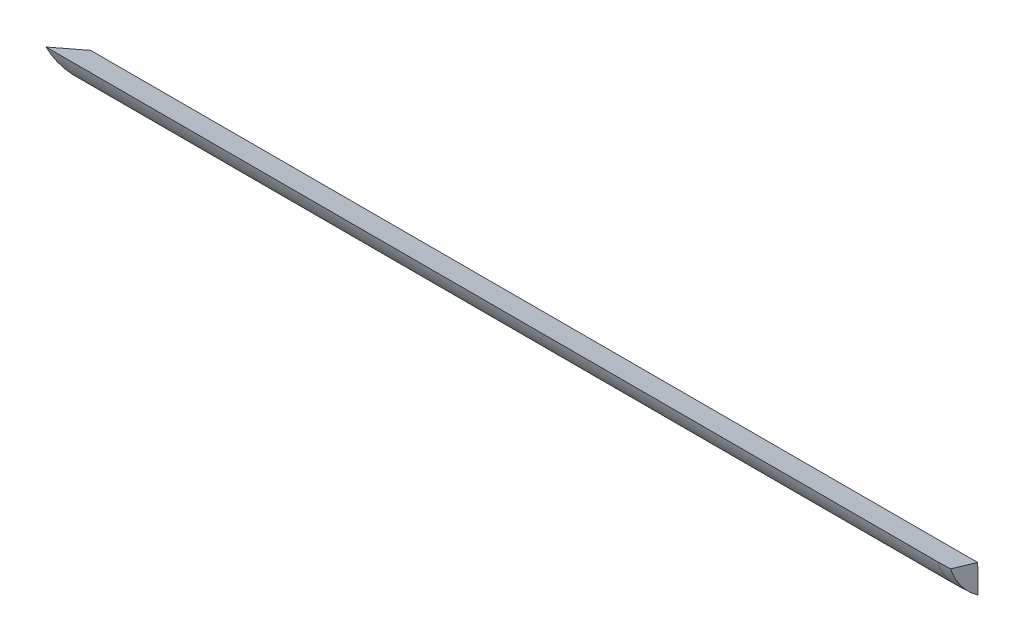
ISO-10303-21;
HEADER;
FILE_DESCRIPTION(('STEP AP214'),'2;1');
FILE_NAME('part.step','',(''),(''),'','','');
FILE_SCHEMA(('AUTOMOTIVE_DESIGN { 1 0 10303 214 1 1 1 1 }'));
ENDSEC;
DATA;
#1=APPLICATION_CONTEXT('core data for automotive mechanical design processes');
#2=APPLICATION_PROTOCOL_DEFINITION('international standard','automotive_design',2000,#1);
#3=PRODUCT_CONTEXT('',#1,'mechanical');
#4=PRODUCT('Part','Part','',(#3));
#5=PRODUCT_RELATED_PRODUCT_CATEGORY('part','',(#4));
#6=PRODUCT_DEFINITION_FORMATION('','',#4);
#7=PRODUCT_DEFINITION_CONTEXT('part definition',#1,'design');
#8=PRODUCT_DEFINITION('design','',#6,#7);
#9=PRODUCT_DEFINITION_SHAPE('','',#8);
#10=(LENGTH_UNIT() NAMED_UNIT(*) SI_UNIT(.MILLI.,.METRE.));
#11=(NAMED_UNIT(*) PLANE_ANGLE_UNIT() SI_UNIT($,.RADIAN.));
#12=(NAMED_UNIT(*) SI_UNIT($,.STERADIAN.) SOLID_ANGLE_UNIT());
#13=UNCERTAINTY_MEASURE_WITH_UNIT(LENGTH_MEASURE(1.E-05),#10,'distance_accuracy_value','');
#14=(GEOMETRIC_REPRESENTATION_CONTEXT(3) GLOBAL_UNCERTAINTY_ASSIGNED_CONTEXT((#13)) GLOBAL_UNIT_ASSIGNED_CONTEXT((#10,
#11,#12)) REPRESENTATION_CONTEXT('',''));
#15=CARTESIAN_POINT('',(0.,0.,0.));
#16=DIRECTION('',(0.,0.,1.));
#17=DIRECTION('',(1.,0.,0.));
#18=AXIS2_PLACEMENT_3D('',#15,#16,#17);
#19=CARTESIAN_POINT('',(38.0952752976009,-83.4050358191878,23.));
#20=CARTESIAN_POINT('',(38.0952752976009,-83.3393714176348,23.));
#21=CARTESIAN_POINT('',(38.0952752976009,-83.2080426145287,23.));
#22=CARTESIAN_POINT('',(38.0952752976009,-83.0329375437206,23.));
#23=CARTESIAN_POINT('',(38.0952752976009,-82.9016087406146,23.));
#24=CARTESIAN_POINT('',(38.0952752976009,-82.7702799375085,23.));
#25=CARTESIAN_POINT('',(38.0952752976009,-82.6170630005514,23.));
#26=CARTESIAN_POINT('',(38.0952752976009,-82.4638460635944,23.));
#27=CARTESIAN_POINT('',(38.0952752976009,-82.3325172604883,23.));
#28=CARTESIAN_POINT('',(38.0952752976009,-82.2011884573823,23.));
#29=CARTESIAN_POINT('',(38.0952752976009,-82.0260833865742,23.));
#30=CARTESIAN_POINT('',(38.0952752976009,-81.8947545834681,23.));
#31=CARTESIAN_POINT('',(38.0952752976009,-81.8290901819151,23.));
#32=CARTESIAN_POINT('',(37.8896109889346,-83.1671640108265,23.3258381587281));
#33=CARTESIAN_POINT('',(37.896231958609,-83.1153063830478,23.3157647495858));
#34=CARTESIAN_POINT('',(37.9094738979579,-83.0115911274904,23.2956179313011));
#35=CARTESIAN_POINT('',(37.9269828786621,-82.8732630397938,23.2686112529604));
#36=CARTESIAN_POINT('',(37.9400473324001,-82.7694977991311,23.2482896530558));
#37=CARTESIAN_POINT('',(37.9530684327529,-82.6657200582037,23.227925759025));
#38=CARTESIAN_POINT('',(37.9681899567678,-82.5446258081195,23.2041002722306));
#39=CARTESIAN_POINT('',(37.9832127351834,-82.4235030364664,23.1801706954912));
#40=CARTESIAN_POINT('',(37.9960267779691,-82.3196644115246,23.1596051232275));
#41=CARTESIAN_POINT('',(38.0087941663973,-82.2158113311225,23.1390017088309));
#42=CARTESIAN_POINT('',(38.0257150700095,-82.0773078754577,23.1114598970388));
#43=CARTESIAN_POINT('',(38.0382658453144,-81.9733829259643,23.090739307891));
#44=CARTESIAN_POINT('',(38.0445412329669,-81.9214204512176,23.0803790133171));
#45=CARTESIAN_POINT('',(37.7041022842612,-82.8742570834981,23.6197433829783));
#46=CARTESIAN_POINT('',(37.717442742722,-82.8364116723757,23.5994466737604));
#47=CARTESIAN_POINT('',(37.7441236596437,-82.760720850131,23.5588532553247));
#48=CARTESIAN_POINT('',(37.7794021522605,-82.659716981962,23.5044380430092));
#49=CARTESIAN_POINT('',(37.8057254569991,-82.5839254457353,23.4634924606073));
#50=CARTESIAN_POINT('',(37.8319614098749,-82.5081087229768,23.4224616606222));
#51=CARTESIAN_POINT('',(37.8624294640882,-82.4196151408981,23.374456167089));
#52=CARTESIAN_POINT('',(37.8926985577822,-82.3310640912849,23.3262409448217));
#53=CARTESIAN_POINT('',(37.918517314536,-82.2551246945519,23.2848037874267));
#54=CARTESIAN_POINT('',(37.9442420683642,-82.1791561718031,23.2432903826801));
#55=CARTESIAN_POINT('',(37.9783356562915,-82.0777989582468,23.1877969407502));
#56=CARTESIAN_POINT('',(38.0036239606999,-82.0016856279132,23.1460474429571));
#57=CARTESIAN_POINT('',(38.0162681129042,-81.9636289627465,23.1251726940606));
#58=CARTESIAN_POINT('',(37.5433395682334,-82.5316242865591,23.8744430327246));
#59=CARTESIAN_POINT('',(37.5635002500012,-82.5080011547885,23.8437697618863));
#60=CARTESIAN_POINT('',(37.6038216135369,-82.4607548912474,23.7824232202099));
#61=CARTESIAN_POINT('',(37.6571360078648,-82.3976347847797,23.7001885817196));
#62=CARTESIAN_POINT('',(37.6969169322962,-82.3502363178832,23.6383098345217));
#63=CARTESIAN_POINT('',(37.7365658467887,-82.3027997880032,23.5763023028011));
#64=CARTESIAN_POINT('',(37.7826104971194,-82.2473956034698,23.503754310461));
#65=CARTESIAN_POINT('',(37.8283544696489,-82.1919045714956,23.4308893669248));
#66=CARTESIAN_POINT('',(37.8673728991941,-82.1442826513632,23.3682677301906));
#67=CARTESIAN_POINT('',(37.9062492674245,-82.0966167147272,23.3055308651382));
#68=CARTESIAN_POINT('',(37.957772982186,-82.0329626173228,23.2216667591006));
#69=CARTESIAN_POINT('',(37.9959897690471,-81.9850778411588,23.1585730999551));
#70=CARTESIAN_POINT('',(38.0150981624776,-81.9611354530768,23.1270262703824));
#71=(BOUNDED_SURFACE() B_SPLINE_SURFACE(3,3,((#19,#20,#21,#22,#23,#24,#25,#26,#27,#28,#29,#30,
#31),(#32,#33,#34,#35,#36,#37,#38,#39,#40,#41,#42,#43,#44),(#45,#46,#47,#48,#49,#50,#51,#52,#53,
#54,#55,#56,#57),(#58,#59,#60,#61,#62,#63,#64,#65,#66,#67,#68,#69,#70)),.UNSPECIFIED.,.F.,.F.,
.F.) B_SPLINE_SURFACE_WITH_KNOTS((4,4),(4,1,1,1,1,1,1,1,1,1,4),(0.,0.5),(0.,0.125,0.25,
0.333333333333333,0.375,0.5,0.625,0.666666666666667,0.75,0.875,1.),
.UNSPECIFIED.) GEOMETRIC_REPRESENTATION_ITEM() RATIONAL_B_SPLINE_SURFACE(((1.,1.,1.,1.,1.,1.,1.,
1.,1.,1.,1.,1.,1.),(0.985445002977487,0.985445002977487,0.985445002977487,0.985445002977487,
0.985445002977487,0.985445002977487,0.985445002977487,0.985445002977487,0.985445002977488,
0.985445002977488,0.985445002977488,0.985445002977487,0.985445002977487),(0.978167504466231,
0.978167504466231,0.978167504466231,0.978167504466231,0.978167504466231,0.978167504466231,
0.978167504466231,0.978167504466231,0.978167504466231,0.978167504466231,0.978167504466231,
0.978167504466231,0.978167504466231),(0.978167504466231,0.978167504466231,0.978167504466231,
0.978167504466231,0.978167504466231,0.978167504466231,0.978167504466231,0.978167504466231,
0.978167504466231,0.978167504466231,0.978167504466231,0.978167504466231,0.978167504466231))) REPRESENTATION_ITEM('') SURFACE());
#72=CARTESIAN_POINT('',(38.0952752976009,-83.4050358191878,23.));
#73=CARTESIAN_POINT('',(37.8896109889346,-83.1671640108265,23.3258381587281));
#74=CARTESIAN_POINT('',(37.7041022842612,-82.8742570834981,23.6197433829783));
#75=CARTESIAN_POINT('',(37.5433395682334,-82.5316242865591,23.8744430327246));
#76=(BOUNDED_CURVE() B_SPLINE_CURVE(3,(#72,#73,#74,#75),.UNSPECIFIED.,.F.,
.F.) B_SPLINE_CURVE_WITH_KNOTS((4,4),(0.,0.5),
.UNSPECIFIED.) CURVE() GEOMETRIC_REPRESENTATION_ITEM() RATIONAL_B_SPLINE_CURVE((1.,
0.985445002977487,0.978167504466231,0.978167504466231)) REPRESENTATION_ITEM(''));
#77=CARTESIAN_POINT('',(38.0952752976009,-83.4050358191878,23.));
#78=VERTEX_POINT('',#77);
#79=CARTESIAN_POINT('',(37.5433395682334,-82.5316242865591,23.8744430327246));
#80=VERTEX_POINT('',#79);
#81=EDGE_CURVE('E146',#78,#80,#76,.T.);
#82=CARTESIAN_POINT('',(37.5433395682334,-82.5316242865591,23.8744430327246));
#83=CARTESIAN_POINT('',(37.5635002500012,-82.5080011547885,23.8437697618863));
#84=CARTESIAN_POINT('',(37.6038216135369,-82.4607548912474,23.7824232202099));
#85=CARTESIAN_POINT('',(37.6571360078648,-82.3976347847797,23.7001885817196));
#86=CARTESIAN_POINT('',(37.6969169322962,-82.3502363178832,23.6383098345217));
#87=CARTESIAN_POINT('',(37.7365658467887,-82.3027997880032,23.5763023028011));
#88=CARTESIAN_POINT('',(37.7826104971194,-82.2473956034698,23.503754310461));
#89=CARTESIAN_POINT('',(37.8283544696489,-82.1919045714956,23.4308893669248));
#90=CARTESIAN_POINT('',(37.8673728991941,-82.1442826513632,23.3682677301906));
#91=CARTESIAN_POINT('',(37.9062492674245,-82.0966167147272,23.3055308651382));
#92=CARTESIAN_POINT('',(37.957772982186,-82.0329626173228,23.2216667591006));
#93=CARTESIAN_POINT('',(37.9959897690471,-81.9850778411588,23.1585730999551));
#94=CARTESIAN_POINT('',(38.0150981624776,-81.9611354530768,23.1270262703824));
#95=(BOUNDED_CURVE() B_SPLINE_CURVE(3,(#82,#83,#84,#85,#86,#87,#88,#89,#90,#91,#92,#93,#94),
.UNSPECIFIED.,.F.,.F.) B_SPLINE_CURVE_WITH_KNOTS((4,1,1,1,1,1,1,1,1,1,4),(0.,0.125,0.25,
0.333333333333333,0.375,0.5,0.625,0.666666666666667,0.75,0.875,1.),
.UNSPECIFIED.) CURVE() GEOMETRIC_REPRESENTATION_ITEM() RATIONAL_B_SPLINE_CURVE((0.978167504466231,
0.978167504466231,0.978167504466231,0.978167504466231,0.978167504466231,0.978167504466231,
0.978167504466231,0.978167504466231,0.978167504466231,0.978167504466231,0.978167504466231,
0.978167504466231,0.978167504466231)) REPRESENTATION_ITEM(''));
#96=CARTESIAN_POINT('',(38.0150981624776,-81.9611354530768,23.1270262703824));
#97=VERTEX_POINT('',#96);
#98=EDGE_CURVE('E154',#80,#97,#95,.T.);
#99=CARTESIAN_POINT('',(38.0150981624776,-81.9611354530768,23.1270262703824));
#100=CARTESIAN_POINT('',(38.0162681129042,-81.9636289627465,23.1251726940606));
#101=CARTESIAN_POINT('',(38.0445412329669,-81.9214204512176,23.0803790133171));
#102=CARTESIAN_POINT('',(38.0952752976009,-81.8290901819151,23.));
#103=(BOUNDED_CURVE() B_SPLINE_CURVE(3,(#99,#100,#101,#102),.UNSPECIFIED.,.F.,
.F.) B_SPLINE_CURVE_WITH_KNOTS((4,4),(0.,0.5),
.UNSPECIFIED.) CURVE() GEOMETRIC_REPRESENTATION_ITEM() RATIONAL_B_SPLINE_CURVE((0.978167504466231,
0.978167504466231,0.985445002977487,1.)) REPRESENTATION_ITEM(''));
#104=CARTESIAN_POINT('',(38.0952752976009,-81.8290901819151,23.));
#105=VERTEX_POINT('',#104);
#106=EDGE_CURVE('E287',#97,#105,#103,.T.);
#107=DIRECTION('',(0.,1.,0.));
#108=VECTOR('',#107,1.);
#109=CARTESIAN_POINT('',(38.0952752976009,-75.,23.));
#110=LINE('',#109,#108);
#111=EDGE_CURVE('E182',#78,#105,#110,.T.);
#112=ORIENTED_EDGE('',*,*,#81,.T.);
#113=ORIENTED_EDGE('',*,*,#98,.T.);
#114=ORIENTED_EDGE('',*,*,#106,.T.);
#115=ORIENTED_EDGE('',*,*,#111,.F.);
#116=EDGE_LOOP('',(#112,#113,#114,#115));
#117=FACE_BOUND('',#116,.T.);
#118=ADVANCED_FACE('F86',(#117),#71,.T.);
#119=CARTESIAN_POINT('',(37.5433395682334,-82.5316242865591,23.8744430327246));
#120=CARTESIAN_POINT('',(37.5635002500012,-82.5080011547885,23.8437697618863));
#121=CARTESIAN_POINT('',(37.6038216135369,-82.4607548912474,23.7824232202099));
#122=CARTESIAN_POINT('',(37.6571360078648,-82.3976347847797,23.7001885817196));
#123=CARTESIAN_POINT('',(37.6969169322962,-82.3502363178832,23.6383098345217));
#124=CARTESIAN_POINT('',(37.7365658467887,-82.3027997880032,23.5763023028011));
#125=CARTESIAN_POINT('',(37.7826104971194,-82.2473956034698,23.503754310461));
#126=CARTESIAN_POINT('',(37.8283544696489,-82.1919045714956,23.4308893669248));
#127=CARTESIAN_POINT('',(37.8673728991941,-82.1442826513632,23.3682677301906));
#128=CARTESIAN_POINT('',(37.9062492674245,-82.0966167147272,23.3055308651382));
#129=CARTESIAN_POINT('',(37.957772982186,-82.0329626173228,23.2216667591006));
#130=CARTESIAN_POINT('',(37.9959897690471,-81.9850778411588,23.1585730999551));
#131=CARTESIAN_POINT('',(38.0150981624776,-81.9611354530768,23.1270262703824));
#132=CARTESIAN_POINT('',(37.3825768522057,-82.18899148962,24.1291426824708));
#133=CARTESIAN_POINT('',(37.4095577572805,-82.1795906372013,24.0880928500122));
#134=CARTESIAN_POINT('',(37.4635195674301,-82.1607889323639,24.005993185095));
#135=CARTESIAN_POINT('',(37.5348698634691,-82.1355525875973,23.89593912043));
#136=CARTESIAN_POINT('',(37.5881084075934,-82.1165471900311,23.8131272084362));
#137=CARTESIAN_POINT('',(37.6411702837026,-82.0974908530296,23.7301429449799));
#138=CARTESIAN_POINT('',(37.7027915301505,-82.0751760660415,23.6330524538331));
#139=CARTESIAN_POINT('',(37.7640103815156,-82.0527450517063,23.535537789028));
#140=CARTESIAN_POINT('',(37.8162284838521,-82.0334406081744,23.4517316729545));
#141=CARTESIAN_POINT('',(37.8682564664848,-82.0140772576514,23.3677713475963));
#142=CARTESIAN_POINT('',(37.9372103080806,-81.9881262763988,23.255536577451));
#143=CARTESIAN_POINT('',(37.9883555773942,-81.9684700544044,23.1710987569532));
#144=CARTESIAN_POINT('',(38.0139282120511,-81.9586419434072,23.1288798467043));
#145=CARTESIAN_POINT('',(37.2513090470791,-81.8067541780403,24.3371129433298));
#146=CARTESIAN_POINT('',(37.2850094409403,-81.811365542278,24.2858398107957));
#147=CARTESIAN_POINT('',(37.3524102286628,-81.8205882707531,24.1832935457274));
#148=CARTESIAN_POINT('',(37.4415300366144,-81.8326761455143,24.0458309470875));
#149=CARTESIAN_POINT('',(37.5080274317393,-81.841644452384,23.9423950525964));
#150=CARTESIAN_POINT('',(37.5743041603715,-81.8505491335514,23.8387438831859));
#151=CARTESIAN_POINT('',(37.6512719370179,-81.8608350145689,23.7174733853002));
#152=CARTESIAN_POINT('',(37.7277371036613,-81.8709757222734,23.5956730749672));
#153=CARTESIAN_POINT('',(37.7929599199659,-81.8795705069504,23.4909953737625));
#154=CARTESIAN_POINT('',(37.8579452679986,-81.8880917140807,23.3861250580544));
#155=CARTESIAN_POINT('',(37.9440717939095,-81.8992869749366,23.2459386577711));
#156=CARTESIAN_POINT('',(38.0079545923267,-81.9074423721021,23.140471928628));
#157=CARTESIAN_POINT('',(38.0398959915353,-81.9115200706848,23.0877385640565));
#158=CARTESIAN_POINT('',(37.1517581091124,-81.3941222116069,24.4948335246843));
#159=CARTESIAN_POINT('',(37.1920794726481,-81.4125403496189,24.4334869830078));
#160=CARTESIAN_POINT('',(37.2727221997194,-81.4493766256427,24.3107938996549));
#161=CARTESIAN_POINT('',(37.3793509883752,-81.4982414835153,24.1463246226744));
#162=CARTESIAN_POINT('',(37.4589128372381,-81.5347733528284,24.0225671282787));
#163=CARTESIAN_POINT('',(37.5382106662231,-81.5712290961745,23.8985520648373));
#164=CARTESIAN_POINT('',(37.6302999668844,-81.6136376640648,23.7534560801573));
#165=CARTESIAN_POINT('',(37.7217879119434,-81.6558725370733,23.6077261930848));
#166=CARTESIAN_POINT('',(37.7998247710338,-81.6919574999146,23.4824829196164));
#167=CARTESIAN_POINT('',(37.8775775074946,-81.7279544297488,23.3570091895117));
#168=CARTESIAN_POINT('',(37.9806249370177,-81.775751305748,23.1892809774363));
#169=CARTESIAN_POINT('',(38.0570585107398,-81.8113105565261,23.0630936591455));
#170=CARTESIAN_POINT('',(38.0952752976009,-81.8290901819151,23.));
#171=CARTESIAN_POINT('',(37.1507770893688,-81.390055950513,24.4963877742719));
#172=CARTESIAN_POINT('',(37.1911636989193,-81.4086101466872,24.4349419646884));
#173=CARTESIAN_POINT('',(37.2719369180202,-81.4457185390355,24.3120503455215));
#174=CARTESIAN_POINT('',(37.3787382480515,-81.4949458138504,24.1473149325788));
#175=CARTESIAN_POINT('',(37.4584288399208,-81.5317493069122,24.0233571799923));
#176=CARTESIAN_POINT('',(37.5378549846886,-81.5684765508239,23.8991414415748));
#177=CARTESIAN_POINT('',(37.6300932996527,-81.6112016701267,23.7538106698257));
#178=CARTESIAN_POINT('',(37.7217292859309,-81.6537528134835,23.607844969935));
#179=CARTESIAN_POINT('',(37.7998924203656,-81.6901086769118,23.4823990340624));
#180=CARTESIAN_POINT('',(37.8777709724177,-81.7263763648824,23.35672226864));
#181=CARTESIAN_POINT('',(37.9809851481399,-81.7745339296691,23.1887226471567));
#182=CARTESIAN_POINT('',(38.0575424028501,-81.8103632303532,23.0623311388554));
#183=CARTESIAN_POINT('',(38.0958210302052,-81.8282778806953,22.9991353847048));
#184=CARTESIAN_POINT('',(37.1497960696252,-81.3859896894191,24.4979420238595));
#185=CARTESIAN_POINT('',(37.1902479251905,-81.4046799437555,24.436396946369));
#186=CARTESIAN_POINT('',(37.271151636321,-81.4420604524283,24.313306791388));
#187=CARTESIAN_POINT('',(37.3781255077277,-81.4916501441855,24.1483052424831));
#188=CARTESIAN_POINT('',(37.4579448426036,-81.5287252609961,24.0241472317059));
#189=CARTESIAN_POINT('',(37.5374993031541,-81.5657240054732,23.8997308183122));
#190=CARTESIAN_POINT('',(37.6298866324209,-81.6087656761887,23.7541652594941));
#191=CARTESIAN_POINT('',(37.7216706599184,-81.6516330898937,23.6079637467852));
#192=CARTESIAN_POINT('',(37.7999600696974,-81.6882598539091,23.4823151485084));
#193=CARTESIAN_POINT('',(37.8779644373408,-81.7247983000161,23.3564353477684));
#194=CARTESIAN_POINT('',(37.9813453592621,-81.7733165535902,23.188164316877));
#195=CARTESIAN_POINT('',(38.0580262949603,-81.8094159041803,23.0615686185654));
#196=CARTESIAN_POINT('',(38.0963667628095,-81.8274655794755,22.9982707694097));
#197=CARTESIAN_POINT('',(37.1488150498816,-81.3819234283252,24.4994962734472));
#198=CARTESIAN_POINT('',(37.1893321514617,-81.4007497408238,24.4378519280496));
#199=CARTESIAN_POINT('',(37.2703663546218,-81.4384023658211,24.3145632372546));
#200=CARTESIAN_POINT('',(37.3775127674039,-81.4883544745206,24.1492955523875));
#201=CARTESIAN_POINT('',(37.4574608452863,-81.5257012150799,24.0249372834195));
#202=CARTESIAN_POINT('',(37.5371436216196,-81.5629714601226,23.9003201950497));
#203=CARTESIAN_POINT('',(37.6296799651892,-81.6063296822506,23.7545198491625));
#204=CARTESIAN_POINT('',(37.7216120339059,-81.6495133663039,23.6080825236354));
#205=CARTESIAN_POINT('',(37.8000277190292,-81.6864110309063,23.4822312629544));
#206=CARTESIAN_POINT('',(37.8781579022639,-81.7232202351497,23.3561484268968));
#207=CARTESIAN_POINT('',(37.9817055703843,-81.7720991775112,23.1876059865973));
#208=CARTESIAN_POINT('',(38.0585101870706,-81.8084685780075,23.0608060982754));
#209=CARTESIAN_POINT('',(38.0969124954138,-81.8266532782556,22.9974061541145));
#210=(BOUNDED_SURFACE() B_SPLINE_SURFACE(3,3,((#119,#120,#121,#122,#123,#124,#125,#126,#127,
#128,#129,#130,#131),(#132,#133,#134,#135,#136,#137,#138,#139,#140,#141,#142,#143,#144),(#145,
#146,#147,#148,#149,#150,#151,#152,#153,#154,#155,#156,#157),(#158,#159,#160,#161,#162,#163,
#164,#165,#166,#167,#168,#169,#170),(#171,#172,#173,#174,#175,#176,#177,#178,#179,#180,#181,
#182,#183),(#184,#185,#186,#187,#188,#189,#190,#191,#192,#193,#194,#195,#196),(#197,#198,#199,
#200,#201,#202,#203,#204,#205,#206,#207,#208,#209)),.UNSPECIFIED.,.F.,.F.,
.F.) B_SPLINE_SURFACE_WITH_KNOTS((4,3,4),(4,1,1,1,1,1,1,1,1,1,4),(0.5,1.,1.005),(0.,0.125,0.25,
0.333333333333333,0.375,0.5,0.625,0.666666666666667,0.75,0.875,1.),
.UNSPECIFIED.) GEOMETRIC_REPRESENTATION_ITEM() RATIONAL_B_SPLINE_SURFACE(((0.978167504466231,
0.978167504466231,0.978167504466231,0.978167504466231,0.978167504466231,0.978167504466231,
0.978167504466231,0.978167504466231,0.978167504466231,0.978167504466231,0.978167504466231,
0.978167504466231,0.978167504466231),(0.978167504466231,0.978167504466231,0.978167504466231,
0.978167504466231,0.978167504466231,0.978167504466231,0.978167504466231,0.978167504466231,
0.978167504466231,0.978167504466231,0.978167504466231,0.978167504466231,0.978167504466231),
(0.985445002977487,0.985445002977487,0.985445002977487,0.985445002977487,0.985445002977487,
0.985445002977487,0.985445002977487,0.985445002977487,0.985445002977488,0.985445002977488,
0.985445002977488,0.985445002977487,0.985445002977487),(1.,1.,1.,1.,1.,1.,1.,1.,1.,1.,1.,1.,1.),
(1.,1.,1.,1.,1.,1.,1.,1.,1.,1.,1.,1.,1.),(1.,1.,1.,1.,1.,1.,1.,1.,1.,1.,1.,1.,1.),(1.,1.,1.,1.,
1.,1.,1.,1.,1.,1.,1.,1.,1.))) REPRESENTATION_ITEM('') SURFACE());
#211=CARTESIAN_POINT('',(37.5433395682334,-82.5316242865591,23.8744430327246));
#212=CARTESIAN_POINT('',(37.3825768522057,-82.18899148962,24.1291426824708));
#213=CARTESIAN_POINT('',(37.2513090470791,-81.8067541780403,24.3371129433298));
#214=CARTESIAN_POINT('',(37.1517581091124,-81.3941222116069,24.4948335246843));
#215=(BOUNDED_CURVE() B_SPLINE_CURVE(3,(#211,#212,#213,#214),.UNSPECIFIED.,.F.,
.F.) B_SPLINE_CURVE_WITH_KNOTS((4,4),(0.5,1.),
.UNSPECIFIED.) CURVE() GEOMETRIC_REPRESENTATION_ITEM() RATIONAL_B_SPLINE_CURVE((0.978167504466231,
0.978167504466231,0.985445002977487,1.)) REPRESENTATION_ITEM(''));
#216=CARTESIAN_POINT('',(37.1517581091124,-81.3941222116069,24.4948335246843));
#217=VERTEX_POINT('',#216);
#218=EDGE_CURVE('E108',#80,#217,#215,.T.);
#219=CARTESIAN_POINT('',(37.1517581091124,-81.3941222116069,24.4948335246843));
#220=CARTESIAN_POINT('',(37.2735357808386,-81.4497048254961,24.3101380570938));
#221=CARTESIAN_POINT('',(37.3939850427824,-81.5048999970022,24.1244508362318));
#222=CARTESIAN_POINT('',(37.6119723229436,-81.6051647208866,23.7828333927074));
#223=CARTESIAN_POINT('',(37.7099267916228,-81.650361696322,23.6272061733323));
#224=CARTESIAN_POINT('',(37.9039915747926,-81.74017198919,23.3146035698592));
#225=CARTESIAN_POINT('',(38.0001016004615,-81.7847852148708,23.1576279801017));
#226=CARTESIAN_POINT('',(38.0952752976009,-81.8290901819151,23.));
#227=B_SPLINE_CURVE_WITH_KNOTS('',3,(#219,#220,#221,#222,#223,#224,#225,#226),.UNSPECIFIED.,.F.,
.F.,(4,2,2,4),(0.,0.684305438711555,1.25237472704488,1.82053225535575),.UNSPECIFIED.);
#228=EDGE_CURVE('E139',#217,#105,#227,.T.);
#229=ORIENTED_EDGE('',*,*,#218,.T.);
#230=ORIENTED_EDGE('',*,*,#228,.T.);
#231=ORIENTED_EDGE('',*,*,#106,.F.);
#232=ORIENTED_EDGE('',*,*,#98,.F.);
#233=EDGE_LOOP('',(#229,#230,#231,#232));
#234=FACE_BOUND('',#233,.T.);
#235=ADVANCED_FACE('F88',(#234),#210,.T.);
#236=CARTESIAN_POINT('',(86.5,0.,0.));
#237=DIRECTION('',(1.,0.,0.));
#238=DIRECTION('',(0.,0.,-1.));
#239=AXIS2_PLACEMENT_3D('',#236,#237,#238);
#240=PLANE('',#239);
#241=CARTESIAN_POINT('',(86.5,0.,0.));
#242=DIRECTION('',(1.,0.,0.));
#243=DIRECTION('',(0.,0.,-1.));
#244=AXIS2_PLACEMENT_3D('',#241,#242,#243);
#245=CIRCLE('',#244,85.);
#246=CARTESIAN_POINT('',(86.5,-81.4007699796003,24.4727327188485));
#247=VERTEX_POINT('',#246);
#248=CARTESIAN_POINT('',(86.4999999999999,-81.8326014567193,22.9875039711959));
#249=VERTEX_POINT('',#248);
#250=EDGE_CURVE('E269',#247,#249,#245,.T.);
#251=ORIENTED_EDGE('',*,*,#250,.F.);
#252=CARTESIAN_POINT('',(86.5,-83.3876780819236,22.9717151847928));
#253=CARTESIAN_POINT('',(86.5,-83.3249888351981,23.0623396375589));
#254=CARTESIAN_POINT('',(86.5,-83.2585143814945,23.1503434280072));
#255=CARTESIAN_POINT('',(86.5,-83.1185265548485,23.3204927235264));
#256=CARTESIAN_POINT('',(86.5,-83.0450165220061,23.4026409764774));
#257=CARTESIAN_POINT('',(86.5,-82.8914248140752,23.5605531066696));
#258=CARTESIAN_POINT('',(86.5,-82.8113427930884,23.6363166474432));
#259=CARTESIAN_POINT('',(86.5,-82.6451329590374,23.7809619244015));
#260=CARTESIAN_POINT('',(86.5,-82.5590029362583,23.8498411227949));
#261=CARTESIAN_POINT('',(86.5,-82.3889494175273,23.9746110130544));
#262=CARTESIAN_POINT('',(86.5,-82.3054705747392,24.0311090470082));
#263=CARTESIAN_POINT('',(86.5,-82.1344324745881,24.1376230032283));
#264=CARTESIAN_POINT('',(86.5,-82.0468718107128,24.1876366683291));
#265=CARTESIAN_POINT('',(86.5,-81.8679404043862,24.2810031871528));
#266=CARTESIAN_POINT('',(86.5,-81.776559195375,24.3243359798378));
#267=CARTESIAN_POINT('',(86.5,-81.5907908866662,24.4039086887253));
#268=CARTESIAN_POINT('',(86.5,-81.4964046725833,24.440150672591));
#269=CARTESIAN_POINT('',(86.5,-81.4007699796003,24.4727327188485));
#270=B_SPLINE_CURVE_WITH_KNOTS('',3,(#252,#253,#254,#255,#256,#257,#258,#259,#260,#261,#262,
#263,#264,#265,#266,#267,#268,#269),.UNSPECIFIED.,.F.,.F.,(4,2,2,2,2,2,2,2,4),(0.,
0.33048473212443,0.660813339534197,0.991159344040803,1.32162667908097,1.62374215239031,
1.92596250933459,2.22907339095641,2.5320957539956),.UNSPECIFIED.);
#271=CARTESIAN_POINT('',(86.5,-83.3876780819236,22.9717151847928));
#272=VERTEX_POINT('',#271);
#273=EDGE_CURVE('E158',#272,#247,#270,.T.);
#274=ORIENTED_EDGE('',*,*,#273,.F.);
#275=CARTESIAN_POINT('',(86.4999999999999,-81.8326014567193,22.9875039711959));
#276=CARTESIAN_POINT('',(86.5,-81.9621947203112,22.9865590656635));
#277=CARTESIAN_POINT('',(86.5,-82.091787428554,22.9855343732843));
#278=CARTESIAN_POINT('',(86.5,-82.3509709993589,22.9833062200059));
#279=CARTESIAN_POINT('',(86.5,-82.4805618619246,22.9821027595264));
#280=CARTESIAN_POINT('',(86.5,-82.7397416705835,22.9794978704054));
#281=CARTESIAN_POINT('',(86.5,-82.8693306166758,22.9780964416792));
#282=CARTESIAN_POINT('',(86.5,-83.128506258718,22.9750749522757));
#283=CARTESIAN_POINT('',(86.5,-83.258092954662,22.9734548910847));
#284=CARTESIAN_POINT('',(86.5,-83.3876780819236,22.9717151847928));
#285=B_SPLINE_CURVE_WITH_KNOTS('',3,(#275,#276,#277,#278,#279,#280,#281,#282,#283,#284),
.UNSPECIFIED.,.F.,.F.,(4,2,2,2,4),(0.,0.388790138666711,0.777579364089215,1.1663687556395,
1.55515906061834),.UNSPECIFIED.);
#286=EDGE_CURVE('E233',#249,#272,#285,.T.);
#287=ORIENTED_EDGE('',*,*,#286,.F.);
#288=EDGE_LOOP('',(#251,#274,#287));
#289=FACE_BOUND('',#288,.T.);
#290=ADVANCED_FACE('F249',(#289),#240,.T.);
#291=CARTESIAN_POINT('',(34.5,-75.,23.));
#292=DIRECTION('',(0.,0.,1.));
#293=DIRECTION('',(1.,0.,0.));
#294=AXIS2_PLACEMENT_3D('',#291,#292,#293);
#295=PLANE('',#294);
#296=DIRECTION('',(1.,0.,0.));
#297=VECTOR('',#296,1.);
#298=CARTESIAN_POINT('',(34.5,-83.4050358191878,23.));
#299=LINE('',#298,#297);
#300=CARTESIAN_POINT('',(85.8162291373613,-83.4050358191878,23.));
#301=VERTEX_POINT('',#300);
#302=EDGE_CURVE('E151',#78,#301,#299,.T.);
#303=ORIENTED_EDGE('',*,*,#302,.F.);
#304=ORIENTED_EDGE('',*,*,#111,.T.);
#305=DIRECTION('',(1.,0.,0.));
#306=VECTOR('',#305,1.);
#307=CARTESIAN_POINT('',(-25.5,-81.8290901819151,23.));
#308=LINE('',#307,#306);
#309=CARTESIAN_POINT('',(86.0496219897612,-81.8290901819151,23.));
#310=VERTEX_POINT('',#309);
#311=EDGE_CURVE('E143',#105,#310,#308,.T.);
#312=ORIENTED_EDGE('',*,*,#311,.T.);
#313=CARTESIAN_POINT('',(34.5,-75.,23.));
#314=DIRECTION('',(0.,0.,1.));
#315=DIRECTION('',(1.,0.,0.));
#316=AXIS2_PLACEMENT_3D('',#313,#314,#315);
#317=CIRCLE('',#316,52.);
#318=EDGE_CURVE('E275',#301,#310,#317,.T.);
#319=ORIENTED_EDGE('',*,*,#318,.F.);
#320=EDGE_LOOP('',(#303,#304,#312,#319));
#321=FACE_BOUND('',#320,.T.);
#322=ADVANCED_FACE('F221',(#321),#295,.F.);
#323=CARTESIAN_POINT('',(34.5,-75.,15.));
#324=DIRECTION('',(0.,0.,1.));
#325=DIRECTION('',(1.,0.,0.));
#326=AXIS2_PLACEMENT_3D('',#323,#324,#325);
#327=TOROIDAL_SURFACE('',#326,52.,8.);
#328=ORIENTED_EDGE('',*,*,#286,.T.);
#329=CARTESIAN_POINT('',(85.8162291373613,-83.4050358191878,23.));
#330=CARTESIAN_POINT('',(85.8982469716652,-83.4016242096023,23.0000007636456));
#331=CARTESIAN_POINT('',(85.9802845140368,-83.3986895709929,22.9987884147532));
#332=CARTESIAN_POINT('',(86.1352948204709,-83.3940478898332,22.9941911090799));
#333=CARTESIAN_POINT('',(86.208272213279,-83.3922413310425,22.9910597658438));
#334=CARTESIAN_POINT('',(86.3541921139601,-83.3893880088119,22.98285102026));
#335=CARTESIAN_POINT('',(86.4271345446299,-83.3883418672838,22.9777720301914));
#336=CARTESIAN_POINT('',(86.5,-83.3876780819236,22.9717151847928));
#337=B_SPLINE_CURVE_WITH_KNOTS('',3,(#329,#330,#331,#332,#333,#334,#335,#336),.UNSPECIFIED.,.F.,
.F.,(4,2,2,4),(0.,0.246254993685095,0.465426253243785,0.684776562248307),.UNSPECIFIED.);
#338=EDGE_CURVE('E207',#301,#272,#337,.T.);
#339=ORIENTED_EDGE('',*,*,#338,.F.);
#340=ORIENTED_EDGE('',*,*,#318,.T.);
#341=CARTESIAN_POINT('',(77.6381475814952,-83.6660385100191,14.9998));
#342=CARTESIAN_POINT('',(77.6464624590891,-83.6244949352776,15.2315785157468));
#343=CARTESIAN_POINT('',(77.6652199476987,-83.5820410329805,15.4627791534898));
#344=CARTESIAN_POINT('',(77.7230004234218,-83.4957200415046,15.922277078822));
#345=CARTESIAN_POINT('',(77.762015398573,-83.4518535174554,16.15057547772));
#346=CARTESIAN_POINT('',(77.8595745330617,-83.3631941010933,16.6021326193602));
#347=CARTESIAN_POINT('',(77.9180688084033,-83.3184038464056,16.8254026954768));
#348=CARTESIAN_POINT('',(78.0538698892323,-83.2282085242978,17.2660318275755));
#349=CARTESIAN_POINT('',(78.1311782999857,-83.1828034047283,17.483390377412));
#350=CARTESIAN_POINT('',(78.3036698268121,-83.0918897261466,17.91048514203));
#351=CARTESIAN_POINT('',(78.3988270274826,-83.04638141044,18.1202318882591));
#352=CARTESIAN_POINT('',(78.6062669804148,-82.9556371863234,18.5312322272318));
#353=CARTESIAN_POINT('',(78.7185559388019,-82.9104013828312,18.7324827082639));
#354=CARTESIAN_POINT('',(78.9593731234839,-82.8206781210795,19.1252679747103));
#355=CARTESIAN_POINT('',(79.0879056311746,-82.7761908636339,19.3168001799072));
#356=CARTESIAN_POINT('',(79.3603119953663,-82.6884444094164,19.6890259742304));
#357=CARTESIAN_POINT('',(79.5041912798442,-82.645185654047,19.8697156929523));
#358=CARTESIAN_POINT('',(79.8126204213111,-82.5586318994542,20.22640285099));
#359=CARTESIAN_POINT('',(79.9777825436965,-82.51541081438,20.4018892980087));
#360=CARTESIAN_POINT('',(80.3225746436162,-82.4314143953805,20.7386606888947));
#361=CARTESIAN_POINT('',(80.5022046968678,-82.390639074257,20.8999455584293));
#362=CARTESIAN_POINT('',(80.8748139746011,-82.3120871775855,21.2072030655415));
#363=CARTESIAN_POINT('',(81.0677966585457,-82.2743113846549,21.353171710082));
#364=CARTESIAN_POINT('',(81.4657475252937,-82.2023430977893,21.6285701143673));
#365=CARTESIAN_POINT('',(81.6707110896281,-82.1681492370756,21.7580061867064));
#366=CARTESIAN_POINT('',(82.0923914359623,-82.1037125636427,21.9999121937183));
#367=CARTESIAN_POINT('',(82.3091612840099,-82.0734901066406,22.1122951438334));
#368=CARTESIAN_POINT('',(82.7519527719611,-82.0177307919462,22.3182261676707));
#369=CARTESIAN_POINT('',(82.9779706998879,-81.9921920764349,22.4117817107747));
#370=CARTESIAN_POINT('',(83.4377167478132,-81.9462658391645,22.5791286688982));
#371=CARTESIAN_POINT('',(83.6714446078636,-81.9258781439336,22.6529207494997));
#372=CARTESIAN_POINT('',(84.1448512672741,-81.890672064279,22.7798634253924));
#373=CARTESIAN_POINT('',(84.3845297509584,-81.8758533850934,22.8330151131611));
#374=CARTESIAN_POINT('',(84.856343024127,-81.8526903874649,22.9159079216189));
#375=CARTESIAN_POINT('',(85.088288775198,-81.8440697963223,22.9466490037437));
#376=CARTESIAN_POINT('',(85.5540924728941,-81.8323886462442,22.988271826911));
#377=CARTESIAN_POINT('',(85.7879503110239,-81.8293277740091,22.9991546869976));
#378=CARTESIAN_POINT('',(86.2556831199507,-81.8288792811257,23.0007503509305));
#379=CARTESIAN_POINT('',(86.4895580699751,-81.8314901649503,22.9914684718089));
#380=CARTESIAN_POINT('',(86.9554845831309,-81.8423927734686,22.9526284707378));
#381=CARTESIAN_POINT('',(87.187536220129,-81.8506842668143,22.9230711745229));
#382=CARTESIAN_POINT('',(87.6352660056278,-81.8722412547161,22.8459539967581));
#383=CARTESIAN_POINT('',(87.8511444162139,-81.8852091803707,22.7994697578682));
#384=CARTESIAN_POINT('',(88.2779415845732,-81.9159605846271,22.6887351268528));
#385=CARTESIAN_POINT('',(88.4888605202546,-81.9337438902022,22.6244853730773));
#386=CARTESIAN_POINT('',(88.9041438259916,-81.9738726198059,22.4786547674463));
#387=CARTESIAN_POINT('',(89.1085089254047,-81.9962175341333,22.3970758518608));
#388=CARTESIAN_POINT('',(89.5092012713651,-82.0451464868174,22.2171695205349));
#389=CARTESIAN_POINT('',(89.7055285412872,-82.0717305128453,22.1188421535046));
#390=CARTESIAN_POINT('',(90.0846214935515,-82.1281404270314,21.9084492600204));
#391=CARTESIAN_POINT('',(90.2675873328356,-82.1578848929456,21.7967222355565));
#392=CARTESIAN_POINT('',(90.6232772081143,-82.2206637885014,21.5587011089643));
#393=CARTESIAN_POINT('',(90.7959977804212,-82.2536993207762,21.4324021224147));
#394=CARTESIAN_POINT('',(91.129951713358,-82.322599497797,21.1662113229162));
#395=CARTESIAN_POINT('',(91.2911877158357,-82.3584634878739,21.0263226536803));
#396=CARTESIAN_POINT('',(91.6011936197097,-82.432561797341,20.7339214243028));
#397=CARTESIAN_POINT('',(91.7499629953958,-82.4707962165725,20.5814083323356));
#398=CARTESIAN_POINT('',(92.0359009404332,-82.5496496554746,20.2628378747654));
#399=CARTESIAN_POINT('',(92.1728997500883,-82.590292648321,20.0966340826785));
#400=CARTESIAN_POINT('',(92.4323261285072,-82.6730187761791,19.753559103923));
#401=CARTESIAN_POINT('',(92.5547536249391,-82.7151019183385,19.5766878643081));
#402=CARTESIAN_POINT('',(92.784363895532,-82.800237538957,19.2134191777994));
#403=CARTESIAN_POINT('',(92.8915396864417,-82.8432904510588,19.0270174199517));
#404=CARTESIAN_POINT('',(93.0899629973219,-82.9298722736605,18.6460302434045));
#405=CARTESIAN_POINT('',(93.1812104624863,-82.9734011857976,18.4514447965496));
#406=CARTESIAN_POINT('',(93.3494265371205,-83.0616164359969,18.0502394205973));
#407=CARTESIAN_POINT('',(93.425962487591,-83.1063034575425,17.8434381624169));
#408=CARTESIAN_POINT('',(93.5612695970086,-83.1952334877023,17.4240937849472));
#409=CARTESIAN_POINT('',(93.6200468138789,-83.2394766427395,17.2115526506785));
#410=CARTESIAN_POINT('',(93.7194915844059,-83.3270657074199,16.7823728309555));
#411=CARTESIAN_POINT('',(93.7601800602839,-83.3704125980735,16.5657391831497));
#412=CARTESIAN_POINT('',(93.8233202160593,-83.4558727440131,16.1296812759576));
#413=CARTESIAN_POINT('',(93.8457811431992,-83.4979866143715,15.9102584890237));
#414=CARTESIAN_POINT('',(93.8660395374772,-83.5609046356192,15.5752660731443));
#415=CARTESIAN_POINT('',(93.8704935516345,-83.5822761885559,15.4601685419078));
#416=CARTESIAN_POINT('',(93.8744104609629,-83.6245266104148,15.2299780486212));
#417=CARTESIAN_POINT('',(93.8738808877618,-83.6454061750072,15.1148853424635));
#418=CARTESIAN_POINT('',(93.8708663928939,-83.6660385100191,14.9998));
#419=B_SPLINE_CURVE_WITH_KNOTS('',3,(#341,#342,#343,#344,#345,#346,#347,#348,#349,#350,#351,
#352,#353,#354,#355,#356,#357,#358,#359,#360,#361,#362,#363,#364,#365,#366,#367,#368,#369,#370,
#371,#372,#373,#374,#375,#376,#377,#378,#379,#380,#381,#382,#383,#384,#385,#386,#387,#388,#389,
#390,#391,#392,#393,#394,#395,#396,#397,#398,#399,#400,#401,#402,#403,#404,#405,#406,#407,#408,
#409,#410,#411,#412,#413,#414,#415,#416,#417,#418),.UNSPECIFIED.,.F.,.F.,(4,2,2,2,2,2,2,2,2,2,2,
2,2,2,2,2,2,2,2,2,2,2,2,2,2,2,2,2,2,2,2,2,2,2,2,2,2,2,4),(0.,0.706568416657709,1.41285759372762,
2.11735178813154,2.82190611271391,3.52544527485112,4.22923990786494,4.9332204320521,
5.63745077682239,6.37108758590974,7.10472823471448,7.83855967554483,8.57211007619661,
9.30928474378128,10.0461663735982,10.7830231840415,11.5198409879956,12.2213432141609,
12.9228059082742,13.6240836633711,14.3253328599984,14.9881424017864,15.6509281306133,
16.3136398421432,16.9763496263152,17.6248967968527,18.2736619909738,18.9222774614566,
19.5709202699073,20.2277347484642,20.8845524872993,21.5416700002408,22.1987897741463,
22.8729851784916,23.5469503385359,24.220133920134,24.8929757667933,25.2443306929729,
25.5951547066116),.UNSPECIFIED.);
#420=EDGE_CURVE('E262',#310,#249,#419,.T.);
#421=ORIENTED_EDGE('',*,*,#420,.T.);
#422=EDGE_LOOP('',(#328,#339,#340,#421));
#423=FACE_BOUND('',#422,.T.);
#424=ADVANCED_FACE('F187',(#423),#327,.F.);
#425=CARTESIAN_POINT('',(-78.5,0.,0.));
#426=DIRECTION('',(1.,0.,0.));
#427=DIRECTION('',(0.,0.,-1.));
#428=AXIS2_PLACEMENT_3D('',#425,#426,#427);
#429=CYLINDRICAL_SURFACE('',#428,85.);
#430=DIRECTION('',(1.,0.,0.));
#431=VECTOR('',#430,1.);
#432=CARTESIAN_POINT('',(-78.5,-81.3941222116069,24.4948335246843));
#433=LINE('',#432,#431);
#434=CARTESIAN_POINT('',(85.8162291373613,-81.3941222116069,24.4948335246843));
#435=VERTEX_POINT('',#434);
#436=EDGE_CURVE('E99',#217,#435,#433,.T.);
#437=ORIENTED_EDGE('',*,*,#436,.T.);
#438=CARTESIAN_POINT('',(85.8162291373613,-81.3941222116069,24.4948335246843));
#439=CARTESIAN_POINT('',(85.8367514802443,-81.3941249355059,24.4948244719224));
#440=CARTESIAN_POINT('',(85.8572739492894,-81.3941416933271,24.4947687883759));
#441=CARTESIAN_POINT('',(85.8983183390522,-81.3942106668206,24.4945395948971));
#442=CARTESIAN_POINT('',(85.9188402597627,-81.3942628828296,24.4943660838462));
#443=CARTESIAN_POINT('',(85.9598794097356,-81.3944101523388,24.4938767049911));
#444=CARTESIAN_POINT('',(85.9803966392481,-81.394505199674,24.4935608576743));
#445=CARTESIAN_POINT('',(86.0214273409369,-81.3947463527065,24.4927594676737));
#446=CARTESIAN_POINT('',(86.0419408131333,-81.3948924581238,24.4922739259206));
#447=CARTESIAN_POINT('',(86.0989337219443,-81.3953565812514,24.4907314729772));
#448=CARTESIAN_POINT('',(86.1354086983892,-81.395719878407,24.4895240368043));
#449=CARTESIAN_POINT('',(86.208346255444,-81.396547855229,24.4867719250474));
#450=CARTESIAN_POINT('',(86.2448088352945,-81.3970125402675,24.4852272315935));
#451=CARTESIAN_POINT('',(86.3177308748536,-81.3980092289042,24.4819136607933));
#452=CARTESIAN_POINT('',(86.3541903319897,-81.3985412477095,24.4801447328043));
#453=CARTESIAN_POINT('',(86.4270999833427,-81.3996388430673,24.4764948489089));
#454=CARTESIAN_POINT('',(86.463550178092,-81.4002044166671,24.4746139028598));
#455=CARTESIAN_POINT('',(86.5,-81.4007699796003,24.4727327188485));
#456=B_SPLINE_CURVE_WITH_KNOTS('',3,(#438,#439,#440,#441,#442,#443,#444,#445,#446,#447,#448,
#449,#450,#451,#452,#453,#454,#455),.UNSPECIFIED.,.F.,.F.,(4,2,2,2,2,2,2,2,4),(0.,
0.0615671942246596,0.123134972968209,0.184693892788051,0.24625247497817,0.355740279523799,
0.46523388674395,0.574752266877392,0.684261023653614),.UNSPECIFIED.);
#457=EDGE_CURVE('E12',#435,#247,#456,.T.);
#458=ORIENTED_EDGE('',*,*,#457,.T.);
#459=ORIENTED_EDGE('',*,*,#250,.T.);
#460=ORIENTED_EDGE('',*,*,#420,.F.);
#461=ORIENTED_EDGE('',*,*,#311,.F.);
#462=ORIENTED_EDGE('',*,*,#228,.F.);
#463=EDGE_LOOP('',(#437,#458,#459,#460,#461,#462));
#464=FACE_BOUND('',#463,.T.);
#465=ADVANCED_FACE('F140',(#464),#429,.F.);
#466=CARTESIAN_POINT('',(38.0952752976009,-83.4050358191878,23.));
#467=CARTESIAN_POINT('',(39.8627180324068,-83.4050358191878,23.));
#468=CARTESIAN_POINT('',(43.3976035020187,-83.4050358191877,23.));
#469=CARTESIAN_POINT('',(48.6999317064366,-83.4050358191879,23.));
#470=CARTESIAN_POINT('',(54.0022599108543,-83.4050358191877,23.));
#471=CARTESIAN_POINT('',(59.3045881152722,-83.4050358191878,23.));
#472=CARTESIAN_POINT('',(64.60691631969,-83.4050358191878,23.));
#473=CARTESIAN_POINT('',(69.5557559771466,-83.4050358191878,23.));
#474=CARTESIAN_POINT('',(73.4441299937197,-83.4050358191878,23.));
#475=CARTESIAN_POINT('',(76.2720383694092,-83.4050358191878,23.));
#476=CARTESIAN_POINT('',(78.569713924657,-83.4050358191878,23.));
#477=CARTESIAN_POINT('',(80.6906452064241,-83.4050358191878,23.));
#478=CARTESIAN_POINT('',(82.3697158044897,-83.4050358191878,23.));
#479=CARTESIAN_POINT('',(83.4301814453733,-83.4050358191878,23.));
#480=CARTESIAN_POINT('',(84.2255306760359,-83.4050358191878,23.));
#481=CARTESIAN_POINT('',(85.0208799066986,-83.4050358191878,23.));
#482=CARTESIAN_POINT('',(85.5511127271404,-83.4050358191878,23.));
#483=CARTESIAN_POINT('',(85.8162291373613,-83.4050358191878,23.));
#484=CARTESIAN_POINT('',(37.6777802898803,-82.9221601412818,23.661445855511));
#485=CARTESIAN_POINT('',(39.4487015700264,-82.9211685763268,23.6631407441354));
#486=CARTESIAN_POINT('',(42.99103602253,-82.9191852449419,23.6665309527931));
#487=CARTESIAN_POINT('',(48.308642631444,-82.9162634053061,23.6715524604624));
#488=CARTESIAN_POINT('',(53.6337245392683,-82.9134481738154,23.6764456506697));
#489=CARTESIAN_POINT('',(58.9680817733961,-82.9107936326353,23.6811445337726));
#490=CARTESIAN_POINT('',(64.3121615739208,-82.908354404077,23.6855818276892));
#491=CARTESIAN_POINT('',(69.30805297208,-82.9063303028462,23.6894150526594));
#492=CARTESIAN_POINT('',(73.2376815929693,-82.9049552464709,23.6921629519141));
#493=CARTESIAN_POINT('',(76.0972448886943,-82.9040738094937,23.6940156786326));
#494=CARTESIAN_POINT('',(78.4213487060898,-82.9034257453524,23.6954372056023));
#495=CARTESIAN_POINT('',(80.5668279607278,-82.9029024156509,23.6966570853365));
#496=CARTESIAN_POINT('',(82.2654334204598,-82.9025443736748,23.6975534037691));
#497=CARTESIAN_POINT('',(83.3381385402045,-82.9023389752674,23.6980938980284));
#498=CARTESIAN_POINT('',(84.1426411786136,-82.9021954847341,23.6984862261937));
#499=CARTESIAN_POINT('',(84.9470829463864,-82.9020627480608,23.6988652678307));
#500=CARTESIAN_POINT('',(85.4833241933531,-82.901981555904,23.6991089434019));
#501=CARTESIAN_POINT('',(85.7514309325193,-82.9019428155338,23.6992284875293));
#502=CARTESIAN_POINT('',(37.3538448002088,-82.2317580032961,24.1746634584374));
#503=CARTESIAN_POINT('',(39.1367879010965,-82.2306343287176,24.1764542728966));
#504=CARTESIAN_POINT('',(42.7031693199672,-82.2283867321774,24.1800363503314));
#505=CARTESIAN_POINT('',(48.0568544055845,-82.2250739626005,24.1853419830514));
#506=CARTESIAN_POINT('',(53.4180257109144,-82.221878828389,24.1905119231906));
#507=CARTESIAN_POINT('',(58.7884761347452,-82.218861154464,24.1954764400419));
#508=CARTESIAN_POINT('',(64.1686343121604,-82.2160814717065,24.2001644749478));
#509=CARTESIAN_POINT('',(69.1981661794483,-82.2137664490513,24.2042142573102));
#510=CARTESIAN_POINT('',(73.1541639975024,-82.2121858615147,24.20711740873));
#511=CARTESIAN_POINT('',(76.0328996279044,-82.2111677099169,24.2090748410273));
#512=CARTESIAN_POINT('',(78.3725465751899,-82.210415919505,24.2105767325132));
#513=CARTESIAN_POINT('',(80.5322569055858,-82.2098049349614,24.2118656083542));
#514=CARTESIAN_POINT('',(82.2422626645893,-82.2093835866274,24.2128126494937));
#515=CARTESIAN_POINT('',(83.3220988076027,-82.2091404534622,24.2133837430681));
#516=CARTESIAN_POINT('',(84.1319538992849,-82.2089698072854,24.2137982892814));
#517=CARTESIAN_POINT('',(84.9417416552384,-82.2088110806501,24.2141988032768));
#518=CARTESIAN_POINT('',(85.4815442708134,-82.2087133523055,24.214456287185));
#519=CARTESIAN_POINT('',(85.7514309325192,-82.2086665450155,24.2145826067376));
#520=CARTESIAN_POINT('',(37.1517581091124,-81.3941222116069,24.4948335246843));
#521=CARTESIAN_POINT('',(38.9541459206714,-81.3941222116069,24.4948335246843));
#522=CARTESIAN_POINT('',(42.5589215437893,-81.3941222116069,24.4948335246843));
#523=CARTESIAN_POINT('',(47.9660850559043,-81.394122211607,24.4948335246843));
#524=CARTESIAN_POINT('',(53.3732482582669,-81.394122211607,24.4948335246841));
#525=CARTESIAN_POINT('',(58.7804126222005,-81.3941222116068,24.4948335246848));
#526=CARTESIAN_POINT('',(64.187572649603,-81.3941222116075,24.4948335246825));
#527=CARTESIAN_POINT('',(69.2342704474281,-81.3941222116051,24.4948335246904));
#528=CARTESIAN_POINT('',(73.1994931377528,-81.3941222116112,24.4948335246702));
#529=CARTESIAN_POINT('',(76.0833719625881,-81.3941222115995,24.4948335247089));
#530=CARTESIAN_POINT('',(78.4264798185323,-81.3941222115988,24.4948335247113));
#531=CARTESIAN_POINT('',(80.5890756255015,-81.3941222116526,24.4948335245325));
#532=CARTESIAN_POINT('',(82.3015947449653,-81.3941222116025,24.4948335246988));
#533=CARTESIAN_POINT('',(83.3830014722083,-81.3941222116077,24.4948335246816));
#534=CARTESIAN_POINT('',(84.1940812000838,-81.3941222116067,24.494833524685));
#535=CARTESIAN_POINT('',(85.0051543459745,-81.394122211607,24.4948335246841));
#536=CARTESIAN_POINT('',(85.5458708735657,-81.394122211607,24.4948335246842));
#537=CARTESIAN_POINT('',(85.8162291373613,-81.3941222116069,24.4948335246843));
#538=(BOUNDED_SURFACE() B_SPLINE_SURFACE(3,3,((#466,#467,#468,#469,#470,#471,#472,#473,#474,
#475,#476,#477,#478,#479,#480,#481,#482,#483),(#484,#485,#486,#487,#488,#489,#490,#491,#492,
#493,#494,#495,#496,#497,#498,#499,#500,#501),(#502,#503,#504,#505,#506,#507,#508,#509,#510,
#511,#512,#513,#514,#515,#516,#517,#518,#519),(#520,#521,#522,#523,#524,#525,#526,#527,#528,
#529,#530,#531,#532,#533,#534,#535,#536,#537)),.UNSPECIFIED.,.F.,.F.,
.F.) B_SPLINE_SURFACE_WITH_KNOTS((4,4),(4,1,1,1,1,1,1,1,1,1,1,1,1,1,1,4),(0.,1.),(0.,
0.0555555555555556,0.111111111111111,0.166666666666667,0.222222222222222,0.277777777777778,
0.333333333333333,0.377777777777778,0.4,0.422222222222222,0.45,0.466666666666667,0.475,
0.483333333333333,0.491666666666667,0.5),
.UNSPECIFIED.) GEOMETRIC_REPRESENTATION_ITEM() RATIONAL_B_SPLINE_SURFACE(((1.,1.,1.,1.,1.,1.,1.,
1.,1.,1.,1.,1.,1.,1.,1.,1.,1.,1.),(0.970890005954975,0.970890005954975,0.970817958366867,
0.970532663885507,0.970109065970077,0.969586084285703,0.969002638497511,0.968437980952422,
0.968005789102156,0.96770699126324,0.967475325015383,0.967275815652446,0.967130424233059,
0.96704358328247,0.966981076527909,0.9669213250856,0.966883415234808,0.966864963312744),
(0.970890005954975,0.970890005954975,0.970817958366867,0.970532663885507,0.970109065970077,
0.969586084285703,0.969002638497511,0.968437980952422,0.968005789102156,0.96770699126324,
0.967475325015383,0.967275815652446,0.967130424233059,0.96704358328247,0.966981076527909,
0.9669213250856,0.966883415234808,0.966864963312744),(1.,1.,1.,1.,1.,1.,1.,1.,1.,1.,1.,1.,1.,1.,
1.,1.,1.,1.))) REPRESENTATION_ITEM('') SURFACE());
#539=CARTESIAN_POINT('',(86.737526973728,-80.1854788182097,20.7689150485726));
#540=DIRECTION('',(-0.970542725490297,0.143734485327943,-0.193357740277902));
#541=DIRECTION('',(-0.19538657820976,0.,0.980726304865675));
#542=AXIS2_PLACEMENT_3D('',#539,#540,#541);
#543=CIRCLE('',#542,4.02393800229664);
#544=EDGE_CURVE('E150',#301,#435,#543,.T.);
#545=ORIENTED_EDGE('',*,*,#218,.F.);
#546=ORIENTED_EDGE('',*,*,#81,.F.);
#547=ORIENTED_EDGE('',*,*,#302,.T.);
#548=ORIENTED_EDGE('',*,*,#544,.T.);
#549=ORIENTED_EDGE('',*,*,#436,.F.);
#550=EDGE_LOOP('',(#545,#546,#547,#548,#549));
#551=FACE_BOUND('',#550,.T.);
#552=ADVANCED_FACE('F148',(#551),#538,.F.);
#553=CARTESIAN_POINT('',(85.8162291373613,-83.4050358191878,23.));
#554=CARTESIAN_POINT('',(85.8185091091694,-83.4049412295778,22.9999994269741));
#555=CARTESIAN_POINT('',(85.8261090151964,-83.4046259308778,22.9999975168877));
#556=CARTESIAN_POINT('',(85.8375095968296,-83.4041601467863,22.9999763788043));
#557=CARTESIAN_POINT('',(85.850430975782,-83.4036401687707,22.9999322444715));
#558=CARTESIAN_POINT('',(85.8656333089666,-83.4030367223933,22.9998591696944));
#559=CARTESIAN_POINT('',(85.8884382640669,-83.4021499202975,22.9997027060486));
#560=CARTESIAN_POINT('',(85.9188476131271,-83.401008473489,22.9993896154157));
#561=CARTESIAN_POINT('',(85.9517936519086,-83.3998251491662,22.9989146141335));
#562=CARTESIAN_POINT('',(85.9936116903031,-83.3983871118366,22.9981487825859));
#563=CARTESIAN_POINT('',(86.0493706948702,-83.3965900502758,22.9968207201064));
#564=CARTESIAN_POINT('',(86.1203322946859,-83.3945327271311,22.9945440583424));
#565=CARTESIAN_POINT('',(86.196345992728,-83.3926029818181,22.9914043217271));
#566=CARTESIAN_POINT('',(86.2723323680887,-83.3909463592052,22.9875676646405));
#567=CARTESIAN_POINT('',(86.3482784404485,-83.3895699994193,22.9830158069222));
#568=CARTESIAN_POINT('',(86.4241796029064,-83.3884491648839,22.9778118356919));
#569=CARTESIAN_POINT('',(86.4747265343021,-83.3879351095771,22.9737474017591));
#570=CARTESIAN_POINT('',(86.5,-83.3876780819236,22.9717151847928));
#571=CARTESIAN_POINT('',(85.7514309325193,-82.9019428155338,23.6992284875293));
#572=CARTESIAN_POINT('',(85.7544450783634,-82.90185655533,23.6992996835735));
#573=CARTESIAN_POINT('',(85.764478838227,-82.901571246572,23.6995342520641));
#574=CARTESIAN_POINT('',(85.7801495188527,-82.9011605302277,23.6998555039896));
#575=CARTESIAN_POINT('',(85.796377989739,-82.9007165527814,23.7001827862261));
#576=CARTESIAN_POINT('',(85.8160169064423,-82.9002155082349,23.7005308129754));
#577=CARTESIAN_POINT('',(85.845657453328,-82.8995110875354,23.7009707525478));
#578=CARTESIAN_POINT('',(85.8839026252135,-82.8986745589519,23.7013767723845));
#579=CARTESIAN_POINT('',(85.924540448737,-82.8978952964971,23.7015936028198));
#580=CARTESIAN_POINT('',(85.9749661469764,-82.8970604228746,23.7015827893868));
#581=CARTESIAN_POINT('',(86.0399901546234,-82.896225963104,23.7010483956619));
#582=CARTESIAN_POINT('',(86.1188478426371,-82.8956516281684,23.6994463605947));
#583=CARTESIAN_POINT('',(86.1994338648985,-82.8955511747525,23.6967366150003));
#584=CARTESIAN_POINT('',(86.2769892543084,-82.8958983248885,23.6931417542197));
#585=CARTESIAN_POINT('',(86.3524078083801,-82.8966314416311,23.6887552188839));
#586=CARTESIAN_POINT('',(86.4265171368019,-82.8976676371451,23.6837243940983));
#587=CARTESIAN_POINT('',(86.4754982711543,-82.8985581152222,23.6799040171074));
#588=CARTESIAN_POINT('',(86.5,-82.8990033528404,23.6779938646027));
#589=CARTESIAN_POINT('',(85.7514309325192,-82.2086665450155,24.2145826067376));
#590=CARTESIAN_POINT('',(85.754450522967,-82.2086070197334,24.2146579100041));
#591=CARTESIAN_POINT('',(85.7645015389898,-82.2084110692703,24.2149060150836));
#592=CARTESIAN_POINT('',(85.7809105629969,-82.2081346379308,24.2152481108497));
#593=CARTESIAN_POINT('',(85.7965711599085,-82.2078433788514,24.2155994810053));
#594=CARTESIAN_POINT('',(85.8162029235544,-82.2075224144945,24.2159764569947));
#595=CARTESIAN_POINT('',(85.8463015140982,-82.2070890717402,24.2164609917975));
#596=CARTESIAN_POINT('',(85.884583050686,-82.2066160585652,24.2169284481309));
#597=CARTESIAN_POINT('',(85.9254011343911,-82.2062310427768,24.2172205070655));
#598=CARTESIAN_POINT('',(85.9760103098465,-82.2059041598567,24.2172902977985));
#599=CARTESIAN_POINT('',(86.0411872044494,-82.2057582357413,24.216842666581));
#600=CARTESIAN_POINT('',(86.1200899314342,-82.2060699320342,24.2153392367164));
#601=CARTESIAN_POINT('',(86.2005788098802,-82.2069127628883,24.2127629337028));
#602=CARTESIAN_POINT('',(86.2779264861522,-82.2081803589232,24.2093692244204));
#603=CARTESIAN_POINT('',(86.3530620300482,-82.2097915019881,24.2052987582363));
#604=CARTESIAN_POINT('',(86.4268451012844,-82.2116544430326,24.2007190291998));
#605=CARTESIAN_POINT('',(86.4756075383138,-82.2130296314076,24.1973703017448));
#606=CARTESIAN_POINT('',(86.5,-82.2137172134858,24.195695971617));
#607=CARTESIAN_POINT('',(85.8162291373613,-81.3941222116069,24.4948335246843));
#608=CARTESIAN_POINT('',(85.8184666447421,-81.3941223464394,24.4948330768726));
#609=CARTESIAN_POINT('',(85.8259250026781,-81.394122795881,24.4948315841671));
#610=CARTESIAN_POINT('',(85.839264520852,-81.3941277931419,24.4948149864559));
#611=CARTESIAN_POINT('',(85.8501878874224,-81.3941381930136,24.4947804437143));
#612=CARTESIAN_POINT('',(85.8650401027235,-81.3941553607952,24.4947234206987));
#613=CARTESIAN_POINT('',(85.8887659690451,-81.3941922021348,24.4946010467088));
#614=CARTESIAN_POINT('',(85.918767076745,-81.3942667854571,24.4943532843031));
#615=CARTESIAN_POINT('',(85.9518016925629,-81.3943754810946,24.4939922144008));
#616=CARTESIAN_POINT('',(85.9937193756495,-81.3945700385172,24.4933457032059));
#617=CARTESIAN_POINT('',(86.0495578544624,-81.3949300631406,24.4921490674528));
#618=CARTESIAN_POINT('',(86.120549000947,-81.395557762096,24.4900624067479));
#619=CARTESIAN_POINT('',(86.1965324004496,-81.3963984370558,24.4872675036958));
#620=CARTESIAN_POINT('',(86.2724537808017,-81.3973736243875,24.4840252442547));
#621=CARTESIAN_POINT('',(86.3483284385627,-81.3984496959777,24.4804474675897));
#622=CARTESIAN_POINT('',(86.4241719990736,-81.3995930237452,24.4766460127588));
#623=CARTESIAN_POINT('',(86.4747239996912,-81.400377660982,24.4740371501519));
#624=CARTESIAN_POINT('',(86.5,-81.4007699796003,24.4727327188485));
#625=(BOUNDED_SURFACE() B_SPLINE_SURFACE(3,3,((#553,#554,#555,#556,#557,#558,#559,#560,#561,
#562,#563,#564,#565,#566,#567,#568,#569,#570),(#571,#572,#573,#574,#575,#576,#577,#578,#579,
#580,#581,#582,#583,#584,#585,#586,#587,#588),(#589,#590,#591,#592,#593,#594,#595,#596,#597,
#598,#599,#600,#601,#602,#603,#604,#605,#606),(#607,#608,#609,#610,#611,#612,#613,#614,#615,
#616,#617,#618,#619,#620,#621,#622,#623,#624)),.UNSPECIFIED.,.F.,.F.,
.F.) B_SPLINE_SURFACE_WITH_KNOTS((4,4),(4,1,1,1,1,1,1,1,1,1,1,1,1,1,1,4),(0.,1.),(0.5,0.505,
0.516666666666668,0.524999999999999,0.533333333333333,0.550000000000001,0.575,0.599999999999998,
0.62222222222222,0.666666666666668,0.722222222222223,0.777777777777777,0.833333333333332,
0.888888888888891,0.944444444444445,1.),
.UNSPECIFIED.) GEOMETRIC_REPRESENTATION_ITEM() RATIONAL_B_SPLINE_SURFACE(((1.,1.,1.,1.,1.,1.,1.,
1.,1.,1.,1.,1.,1.,1.,1.,1.,1.,1.),(0.966864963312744,0.966853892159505,0.966817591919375,
0.966766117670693,0.966711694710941,0.966651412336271,0.966569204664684,0.966476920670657,
0.966397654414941,0.966319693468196,0.966254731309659,0.966232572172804,0.966260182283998,
0.966318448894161,0.966386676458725,0.966444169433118,0.966461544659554,0.966461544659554),
(0.966864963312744,0.966853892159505,0.966817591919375,0.966766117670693,0.966711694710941,
0.966651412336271,0.966569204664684,0.966476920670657,0.966397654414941,0.966319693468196,
0.966254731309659,0.966232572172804,0.966260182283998,0.966318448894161,0.966386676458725,
0.966444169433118,0.966461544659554,0.966461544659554),(1.,1.,1.,1.,1.,1.,1.,1.,1.,1.,1.,1.,1.,
1.,1.,1.,1.,1.))) REPRESENTATION_ITEM('') SURFACE());
#626=ORIENTED_EDGE('',*,*,#544,.F.);
#627=ORIENTED_EDGE('',*,*,#338,.T.);
#628=ORIENTED_EDGE('',*,*,#273,.T.);
#629=ORIENTED_EDGE('',*,*,#457,.F.);
#630=EDGE_LOOP('',(#626,#627,#628,#629));
#631=FACE_BOUND('',#630,.T.);
#632=ADVANCED_FACE('F188',(#631),#625,.F.);
#633=CLOSED_SHELL('',(#118,#235,#290,#322,#424,#465,#552,#632));
#634=MANIFOLD_SOLID_BREP('B2',#633);
#635=ADVANCED_BREP_SHAPE_REPRESENTATION('',(#18,#634),#14);
#636=SHAPE_DEFINITION_REPRESENTATION(#9,#635);
ENDSEC;
END-ISO-10303-21;
